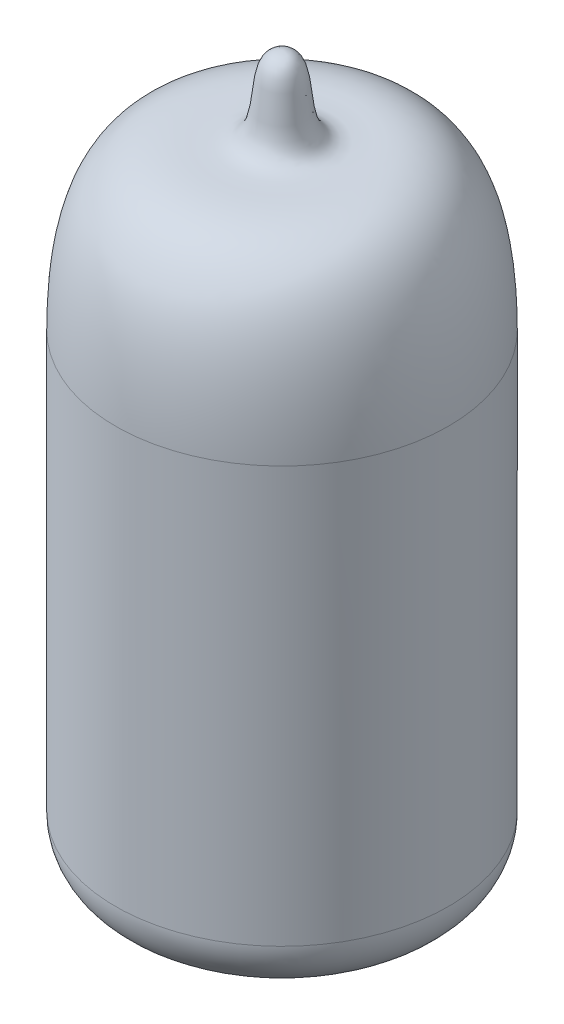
from build123d import *


with BuildPart() as part:
    # Sketch1 → Revolve1 (revolve)
    with BuildSketch(Plane.XY, mode=Mode.PRIVATE) as revolve1_sk:
        with BuildLine():
            Line((0, 0), (7.5, 0))
            ThreePointArc((7.5, 0), (9.974873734, 1.025126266), (11, 3.5))
            Line((11, 3.5), (11, 31))
            add(Edge.make_bspline(
                [(0, 47), (1.868508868, 47), (0.839979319, 43.098036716), (3.690772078, 40.909332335), (11, 43.731932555), (11, 31)],
                knots=[0, 0, 0, 0, 0.457352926, 0.557352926, 1, 1, 1, 1], degree=3))
            Line((0, 47), (0, 46.7))
            add(Edge.make_bspline(
                [(0, 46.7), (0.089835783, 46.7), (0.286730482, 46.675440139), (0.526826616, 46.561370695), (0.862385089, 46.18251662), (1.044651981, 45.207868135), (1.153282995, 44.076896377), (1.27957898, 43.224881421), (1.526130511, 42.440350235), (2.004678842, 41.769741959), (2.893610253, 41.423589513), (4.086898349, 41.455426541), (5.493916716, 41.46358206), (6.96424187, 41.18629835), (8.123784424, 40.497710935), (8.965606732, 39.51470229), (9.535509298, 38.514305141), (10.020875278, 37.207692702), (10.397250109, 35.559145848), (10.600364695, 33.859238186), (10.685249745, 32.308941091), (10.7, 31.427518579), (10.7, 31)],
                knots=[0, 0, 0, 0, 0.03125, 0.0625, 0.125, 0.25, 0.3125, 0.375, 0.4375, 0.5, 0.5625, 0.625, 0.6875, 0.75, 0.8125, 0.84375, 0.875, 0.90625, 0.9375, 0.96875, 0.984375, 1, 1, 1, 1], degree=3))
            Line((10.7, 31), (10.7, 5.88640066))
            ThreePointArc((10.7, 5.88640066), (9.7627417, 3.62365896), (7.5, 2.68640066))
            Line((7.5, 2.68640066), (0, 2.68640066))
            Line((0, 2.68640066), (0, 0.3))
            Line((0, 0.3), (0, 0))
        make_face()
    revolve(revolve1_sk.sketch.rotate(Axis((0, 0, 0), (0, 1, 0)), 90), axis=Axis((0, 0, 0), (0, 1, 0)))


solid = part.part
